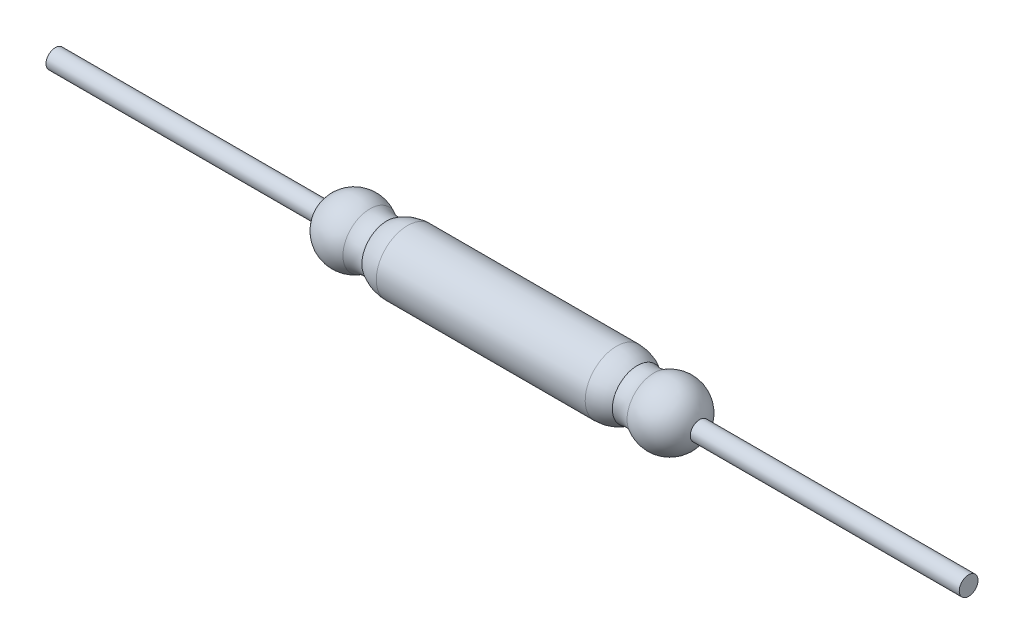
from build123d import *


with BuildPart() as part:
    # Esquisse1 → R_volution1 (revolve)
    with BuildSketch(Plane.XY):
        with BuildLine():
            Line((21.002542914, 1), (27.683096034, 1))
            ThreePointArc((27.683096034, 1), (28.030203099, 0.948065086), (28.346908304, 0.796809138))
            ThreePointArc((28.346908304, 0.796809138), (28.622514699, 0.774884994), (28.884426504, 0.863438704))
            ThreePointArc((28.884426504, 0.863438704), (29.749262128, 0.932804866), (30.342819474, 0.3))
            Line((30.342819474, 0.3), (38.941532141, 0.3))
            Line((38.941532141, 0.3), (38.941532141, 0))
            Line((38.941532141, 0), (9.744106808, 0))
            Line((9.744106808, 0), (9.744106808, 0.3))
            Line((9.744106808, 0.3), (18.342819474, 0.3))
            ThreePointArc((18.342819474, 0.3), (18.93637682, 0.932804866), (19.801212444, 0.863438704))
            ThreePointArc((19.801212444, 0.863438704), (20.063124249, 0.774884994), (20.338730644, 0.796809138))
            ThreePointArc((20.338730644, 0.796809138), (20.65543585, 0.948065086), (21.002542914, 1))
        make_face()
    revolve(axis=Axis((38.941532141, 0, 0), (-1, 0, 0)))


solid = part.part
